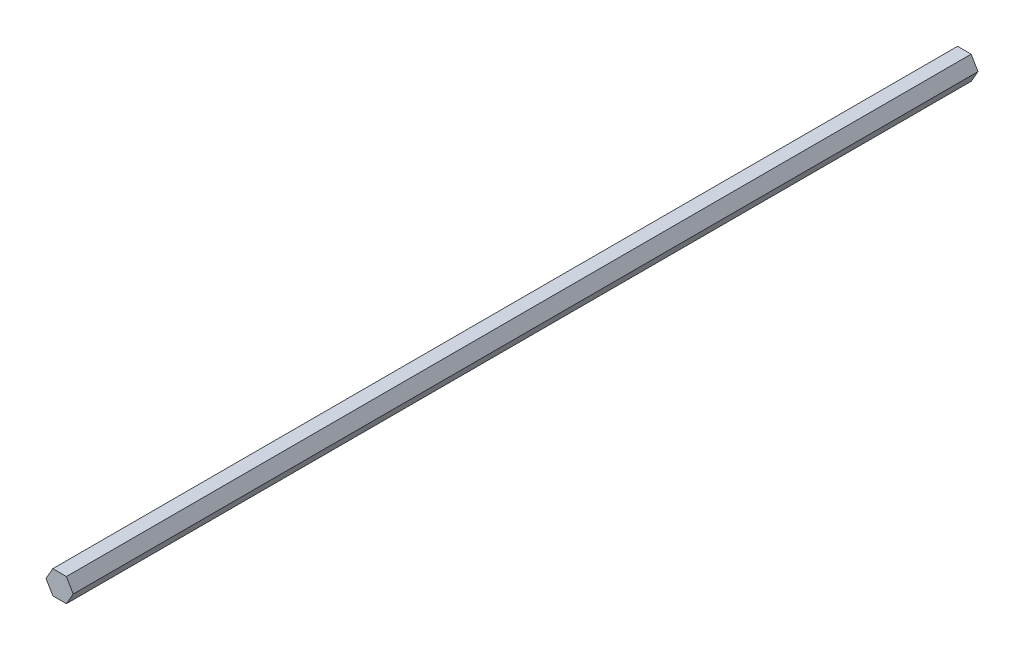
ISO-10303-21;
HEADER;
FILE_DESCRIPTION(('STEP AP214'),'2;1');
FILE_NAME('part.step','',(''),(''),'','','');
FILE_SCHEMA(('AUTOMOTIVE_DESIGN { 1 0 10303 214 1 1 1 1 }'));
ENDSEC;
DATA;
#1=APPLICATION_CONTEXT('core data for automotive mechanical design processes');
#2=APPLICATION_PROTOCOL_DEFINITION('international standard','automotive_design',2000,#1);
#3=PRODUCT_CONTEXT('',#1,'mechanical');
#4=PRODUCT('Part','Part','',(#3));
#5=PRODUCT_RELATED_PRODUCT_CATEGORY('part','',(#4));
#6=PRODUCT_DEFINITION_FORMATION('','',#4);
#7=PRODUCT_DEFINITION_CONTEXT('part definition',#1,'design');
#8=PRODUCT_DEFINITION('design','',#6,#7);
#9=PRODUCT_DEFINITION_SHAPE('','',#8);
#10=(LENGTH_UNIT() NAMED_UNIT(*) SI_UNIT(.MILLI.,.METRE.));
#11=(NAMED_UNIT(*) PLANE_ANGLE_UNIT() SI_UNIT($,.RADIAN.));
#12=(NAMED_UNIT(*) SI_UNIT($,.STERADIAN.) SOLID_ANGLE_UNIT());
#13=UNCERTAINTY_MEASURE_WITH_UNIT(LENGTH_MEASURE(1.E-05),#10,'distance_accuracy_value','');
#14=(GEOMETRIC_REPRESENTATION_CONTEXT(3) GLOBAL_UNCERTAINTY_ASSIGNED_CONTEXT((#13)) GLOBAL_UNIT_ASSIGNED_CONTEXT((#10,
#11,#12)) REPRESENTATION_CONTEXT('',''));
#15=CARTESIAN_POINT('',(0.,0.,0.));
#16=DIRECTION('',(0.,0.,1.));
#17=DIRECTION('',(1.,0.,0.));
#18=AXIS2_PLACEMENT_3D('',#15,#16,#17);
#19=CARTESIAN_POINT('',(2.29135888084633,-3.96875,304.8));
#20=DIRECTION('',(-0.866025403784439,0.5,0.));
#21=DIRECTION('',(-0.5,-0.866025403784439,0.));
#22=AXIS2_PLACEMENT_3D('',#19,#20,#21);
#23=PLANE('',#22);
#24=DIRECTION('',(0.5,0.866025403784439,0.));
#25=VECTOR('',#24,1.);
#26=CARTESIAN_POINT('',(2.29135888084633,-3.96875,0.));
#27=LINE('',#26,#25);
#28=CARTESIAN_POINT('',(2.29135888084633,-3.96875,0.));
#29=VERTEX_POINT('',#28);
#30=CARTESIAN_POINT('',(4.58271776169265,0.,0.));
#31=VERTEX_POINT('',#30);
#32=EDGE_CURVE('E115',#29,#31,#27,.T.);
#33=ORIENTED_EDGE('',*,*,#32,.T.);
#34=DIRECTION('',(0.,0.,-1.));
#35=VECTOR('',#34,1.);
#36=CARTESIAN_POINT('',(4.58271776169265,0.,304.8));
#37=LINE('',#36,#35);
#38=CARTESIAN_POINT('',(4.58271776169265,0.,304.8));
#39=VERTEX_POINT('',#38);
#40=EDGE_CURVE('E11',#39,#31,#37,.T.);
#41=ORIENTED_EDGE('',*,*,#40,.F.);
#42=DIRECTION('',(0.5,0.866025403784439,0.));
#43=VECTOR('',#42,1.);
#44=CARTESIAN_POINT('',(2.29135888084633,-3.96875,304.8));
#45=LINE('',#44,#43);
#46=CARTESIAN_POINT('',(2.29135888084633,-3.96875,304.8));
#47=VERTEX_POINT('',#46);
#48=EDGE_CURVE('E125',#47,#39,#45,.T.);
#49=ORIENTED_EDGE('',*,*,#48,.F.);
#50=DIRECTION('',(0.,0.,-1.));
#51=VECTOR('',#50,1.);
#52=CARTESIAN_POINT('',(2.29135888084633,-3.96875,304.8));
#53=LINE('',#52,#51);
#54=EDGE_CURVE('E111',#47,#29,#53,.T.);
#55=ORIENTED_EDGE('',*,*,#54,.T.);
#56=EDGE_LOOP('',(#33,#41,#49,#55));
#57=FACE_BOUND('',#56,.T.);
#58=ADVANCED_FACE('F31',(#57),#23,.F.);
#59=CARTESIAN_POINT('',(4.58271776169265,0.,304.8));
#60=DIRECTION('',(-0.866025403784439,-0.5,0.));
#61=DIRECTION('',(0.5,-0.866025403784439,0.));
#62=AXIS2_PLACEMENT_3D('',#59,#60,#61);
#63=PLANE('',#62);
#64=DIRECTION('',(-0.5,0.866025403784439,0.));
#65=VECTOR('',#64,1.);
#66=CARTESIAN_POINT('',(4.58271776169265,0.,0.));
#67=LINE('',#66,#65);
#68=CARTESIAN_POINT('',(2.29135888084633,3.96875,0.));
#69=VERTEX_POINT('',#68);
#70=EDGE_CURVE('E118',#31,#69,#67,.T.);
#71=ORIENTED_EDGE('',*,*,#70,.T.);
#72=DIRECTION('',(0.,0.,-1.));
#73=VECTOR('',#72,1.);
#74=CARTESIAN_POINT('',(2.29135888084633,3.96875,304.8));
#75=LINE('',#74,#73);
#76=CARTESIAN_POINT('',(2.29135888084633,3.96875,304.8));
#77=VERTEX_POINT('',#76);
#78=EDGE_CURVE('E39',#77,#69,#75,.T.);
#79=ORIENTED_EDGE('',*,*,#78,.F.);
#80=DIRECTION('',(-0.5,0.866025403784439,0.));
#81=VECTOR('',#80,1.);
#82=CARTESIAN_POINT('',(4.58271776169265,0.,304.8));
#83=LINE('',#82,#81);
#84=EDGE_CURVE('E84',#39,#77,#83,.T.);
#85=ORIENTED_EDGE('',*,*,#84,.F.);
#86=ORIENTED_EDGE('',*,*,#40,.T.);
#87=EDGE_LOOP('',(#71,#79,#85,#86));
#88=FACE_BOUND('',#87,.T.);
#89=ADVANCED_FACE('F149',(#88),#63,.F.);
#90=CARTESIAN_POINT('',(2.29135888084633,3.96875,304.8));
#91=DIRECTION('',(0.,-1.,0.));
#92=DIRECTION('',(0.,0.,-1.));
#93=AXIS2_PLACEMENT_3D('',#90,#91,#92);
#94=PLANE('',#93);
#95=DIRECTION('',(-1.,0.,0.));
#96=VECTOR('',#95,1.);
#97=CARTESIAN_POINT('',(2.29135888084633,3.96875,0.));
#98=LINE('',#97,#96);
#99=CARTESIAN_POINT('',(-2.29135888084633,3.96875,0.));
#100=VERTEX_POINT('',#99);
#101=EDGE_CURVE('E120',#69,#100,#98,.T.);
#102=ORIENTED_EDGE('',*,*,#101,.T.);
#103=DIRECTION('',(0.,0.,-1.));
#104=VECTOR('',#103,1.);
#105=CARTESIAN_POINT('',(-2.29135888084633,3.96875,304.8));
#106=LINE('',#105,#104);
#107=CARTESIAN_POINT('',(-2.29135888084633,3.96875,304.8));
#108=VERTEX_POINT('',#107);
#109=EDGE_CURVE('E106',#108,#100,#106,.T.);
#110=ORIENTED_EDGE('',*,*,#109,.F.);
#111=DIRECTION('',(-1.,0.,0.));
#112=VECTOR('',#111,1.);
#113=CARTESIAN_POINT('',(2.29135888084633,3.96875,304.8));
#114=LINE('',#113,#112);
#115=EDGE_CURVE('E97',#77,#108,#114,.T.);
#116=ORIENTED_EDGE('',*,*,#115,.F.);
#117=ORIENTED_EDGE('',*,*,#78,.T.);
#118=EDGE_LOOP('',(#102,#110,#116,#117));
#119=FACE_BOUND('',#118,.T.);
#120=ADVANCED_FACE('F131',(#119),#94,.F.);
#121=CARTESIAN_POINT('',(-2.29135888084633,3.96875,304.8));
#122=DIRECTION('',(0.866025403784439,-0.5,0.));
#123=DIRECTION('',(0.5,0.866025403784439,0.));
#124=AXIS2_PLACEMENT_3D('',#121,#122,#123);
#125=PLANE('',#124);
#126=DIRECTION('',(-0.5,-0.866025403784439,0.));
#127=VECTOR('',#126,1.);
#128=CARTESIAN_POINT('',(-2.29135888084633,3.96875,0.));
#129=LINE('',#128,#127);
#130=CARTESIAN_POINT('',(-4.58271776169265,0.,0.));
#131=VERTEX_POINT('',#130);
#132=EDGE_CURVE('E105',#100,#131,#129,.T.);
#133=ORIENTED_EDGE('',*,*,#132,.T.);
#134=DIRECTION('',(0.,0.,-1.));
#135=VECTOR('',#134,1.);
#136=CARTESIAN_POINT('',(-4.58271776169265,0.,304.8));
#137=LINE('',#136,#135);
#138=CARTESIAN_POINT('',(-4.58271776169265,0.,304.8));
#139=VERTEX_POINT('',#138);
#140=EDGE_CURVE('E102',#139,#131,#137,.T.);
#141=ORIENTED_EDGE('',*,*,#140,.F.);
#142=DIRECTION('',(-0.5,-0.866025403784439,0.));
#143=VECTOR('',#142,1.);
#144=CARTESIAN_POINT('',(-2.29135888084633,3.96875,304.8));
#145=LINE('',#144,#143);
#146=EDGE_CURVE('E91',#108,#139,#145,.T.);
#147=ORIENTED_EDGE('',*,*,#146,.F.);
#148=ORIENTED_EDGE('',*,*,#109,.T.);
#149=EDGE_LOOP('',(#133,#141,#147,#148));
#150=FACE_BOUND('',#149,.T.);
#151=ADVANCED_FACE('F103',(#150),#125,.F.);
#152=CARTESIAN_POINT('',(-4.58271776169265,0.,304.8));
#153=DIRECTION('',(0.866025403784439,0.5,0.));
#154=DIRECTION('',(-0.5,0.866025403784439,0.));
#155=AXIS2_PLACEMENT_3D('',#152,#153,#154);
#156=PLANE('',#155);
#157=DIRECTION('',(0.5,-0.866025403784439,0.));
#158=VECTOR('',#157,1.);
#159=CARTESIAN_POINT('',(-4.58271776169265,0.,0.));
#160=LINE('',#159,#158);
#161=CARTESIAN_POINT('',(-2.29135888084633,-3.96875,0.));
#162=VERTEX_POINT('',#161);
#163=EDGE_CURVE('E70',#131,#162,#160,.T.);
#164=ORIENTED_EDGE('',*,*,#163,.T.);
#165=DIRECTION('',(0.,0.,-1.));
#166=VECTOR('',#165,1.);
#167=CARTESIAN_POINT('',(-2.29135888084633,-3.96875,304.8));
#168=LINE('',#167,#166);
#169=CARTESIAN_POINT('',(-2.29135888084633,-3.96875,304.8));
#170=VERTEX_POINT('',#169);
#171=EDGE_CURVE('E107',#170,#162,#168,.T.);
#172=ORIENTED_EDGE('',*,*,#171,.F.);
#173=DIRECTION('',(0.5,-0.866025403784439,0.));
#174=VECTOR('',#173,1.);
#175=CARTESIAN_POINT('',(-4.58271776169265,0.,304.8));
#176=LINE('',#175,#174);
#177=EDGE_CURVE('E95',#139,#170,#176,.T.);
#178=ORIENTED_EDGE('',*,*,#177,.F.);
#179=ORIENTED_EDGE('',*,*,#140,.T.);
#180=EDGE_LOOP('',(#164,#172,#178,#179));
#181=FACE_BOUND('',#180,.T.);
#182=ADVANCED_FACE('F109',(#181),#156,.F.);
#183=CARTESIAN_POINT('',(-2.29135888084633,-3.96875,304.8));
#184=DIRECTION('',(0.,1.,0.));
#185=DIRECTION('',(0.,0.,1.));
#186=AXIS2_PLACEMENT_3D('',#183,#184,#185);
#187=PLANE('',#186);
#188=DIRECTION('',(1.,0.,0.));
#189=VECTOR('',#188,1.);
#190=CARTESIAN_POINT('',(-2.29135888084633,-3.96875,0.));
#191=LINE('',#190,#189);
#192=EDGE_CURVE('E76',#162,#29,#191,.T.);
#193=ORIENTED_EDGE('',*,*,#192,.T.);
#194=ORIENTED_EDGE('',*,*,#54,.F.);
#195=DIRECTION('',(1.,0.,0.));
#196=VECTOR('',#195,1.);
#197=CARTESIAN_POINT('',(-2.29135888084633,-3.96875,304.8));
#198=LINE('',#197,#196);
#199=EDGE_CURVE('E47',#170,#47,#198,.T.);
#200=ORIENTED_EDGE('',*,*,#199,.F.);
#201=ORIENTED_EDGE('',*,*,#171,.T.);
#202=EDGE_LOOP('',(#193,#194,#200,#201));
#203=FACE_BOUND('',#202,.T.);
#204=ADVANCED_FACE('F138',(#203),#187,.F.);
#205=CARTESIAN_POINT('',(6.87407664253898,3.96875,304.8));
#206=DIRECTION('',(0.,0.,1.));
#207=DIRECTION('',(1.,0.,0.));
#208=AXIS2_PLACEMENT_3D('',#205,#206,#207);
#209=PLANE('',#208);
#210=ORIENTED_EDGE('',*,*,#48,.T.);
#211=ORIENTED_EDGE('',*,*,#84,.T.);
#212=ORIENTED_EDGE('',*,*,#115,.T.);
#213=ORIENTED_EDGE('',*,*,#146,.T.);
#214=ORIENTED_EDGE('',*,*,#177,.T.);
#215=ORIENTED_EDGE('',*,*,#199,.T.);
#216=EDGE_LOOP('',(#210,#211,#212,#213,#214,#215));
#217=FACE_BOUND('',#216,.T.);
#218=ADVANCED_FACE('F93',(#217),#209,.T.);
#219=CARTESIAN_POINT('',(6.87407664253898,3.96875,0.));
#220=DIRECTION('',(0.,0.,1.));
#221=DIRECTION('',(1.,0.,0.));
#222=AXIS2_PLACEMENT_3D('',#219,#220,#221);
#223=PLANE('',#222);
#224=ORIENTED_EDGE('',*,*,#32,.F.);
#225=ORIENTED_EDGE('',*,*,#192,.F.);
#226=ORIENTED_EDGE('',*,*,#163,.F.);
#227=ORIENTED_EDGE('',*,*,#132,.F.);
#228=ORIENTED_EDGE('',*,*,#101,.F.);
#229=ORIENTED_EDGE('',*,*,#70,.F.);
#230=EDGE_LOOP('',(#224,#225,#226,#227,#228,#229));
#231=FACE_BOUND('',#230,.T.);
#232=ADVANCED_FACE('F134',(#231),#223,.F.);
#233=CLOSED_SHELL('',(#58,#89,#120,#151,#182,#204,#218,#232));
#234=MANIFOLD_SOLID_BREP('B2',#233);
#235=ADVANCED_BREP_SHAPE_REPRESENTATION('',(#18,#234),#14);
#236=SHAPE_DEFINITION_REPRESENTATION(#9,#235);
ENDSEC;
END-ISO-10303-21;
